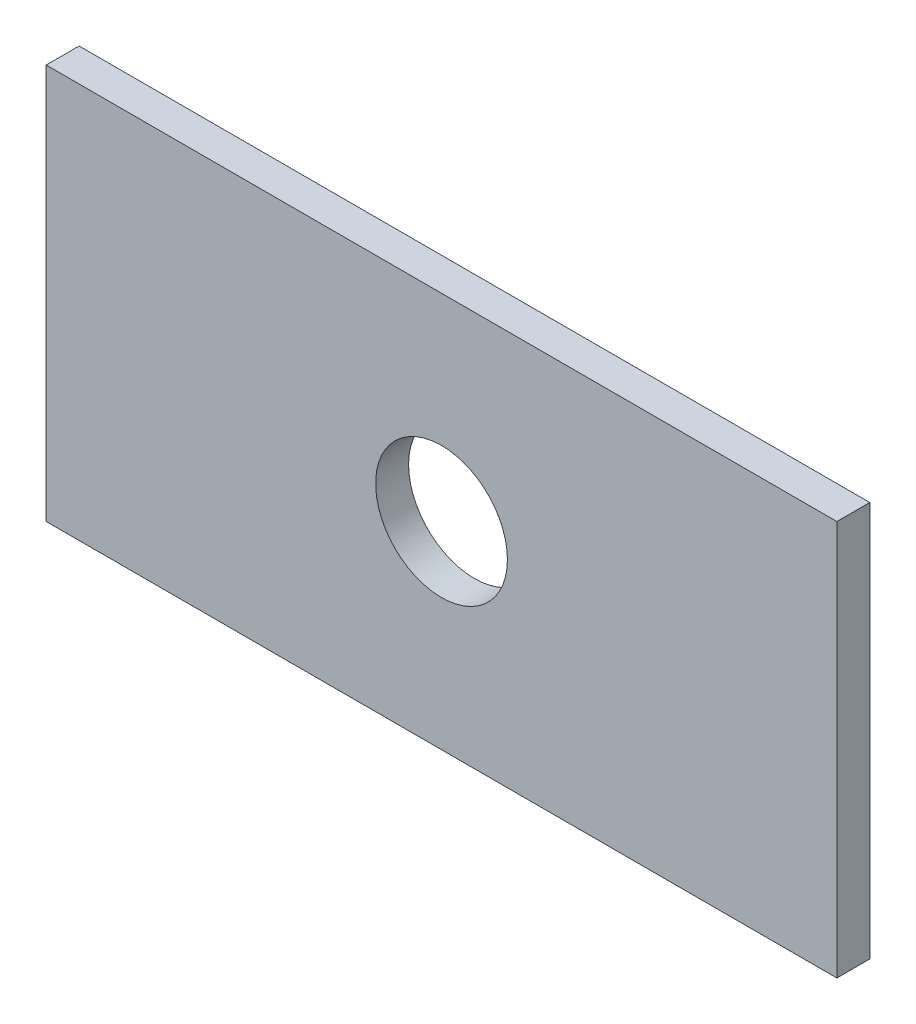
ISO-10303-21;
HEADER;
FILE_DESCRIPTION(('STEP AP214'),'2;1');
FILE_NAME('part.step','',(''),(''),'','','');
FILE_SCHEMA(('AUTOMOTIVE_DESIGN { 1 0 10303 214 1 1 1 1 }'));
ENDSEC;
DATA;
#1=APPLICATION_CONTEXT('core data for automotive mechanical design processes');
#2=APPLICATION_PROTOCOL_DEFINITION('international standard','automotive_design',2000,#1);
#3=PRODUCT_CONTEXT('',#1,'mechanical');
#4=PRODUCT('Part','Part','',(#3));
#5=PRODUCT_RELATED_PRODUCT_CATEGORY('part','',(#4));
#6=PRODUCT_DEFINITION_FORMATION('','',#4);
#7=PRODUCT_DEFINITION_CONTEXT('part definition',#1,'design');
#8=PRODUCT_DEFINITION('design','',#6,#7);
#9=PRODUCT_DEFINITION_SHAPE('','',#8);
#10=(LENGTH_UNIT() NAMED_UNIT(*) SI_UNIT(.MILLI.,.METRE.));
#11=(NAMED_UNIT(*) PLANE_ANGLE_UNIT() SI_UNIT($,.RADIAN.));
#12=(NAMED_UNIT(*) SI_UNIT($,.STERADIAN.) SOLID_ANGLE_UNIT());
#13=UNCERTAINTY_MEASURE_WITH_UNIT(LENGTH_MEASURE(1.E-05),#10,'distance_accuracy_value','');
#14=(GEOMETRIC_REPRESENTATION_CONTEXT(3) GLOBAL_UNCERTAINTY_ASSIGNED_CONTEXT((#13)) GLOBAL_UNIT_ASSIGNED_CONTEXT((#10,
#11,#12)) REPRESENTATION_CONTEXT('',''));
#15=CARTESIAN_POINT('',(0.,0.,0.));
#16=DIRECTION('',(0.,0.,1.));
#17=DIRECTION('',(1.,0.,0.));
#18=AXIS2_PLACEMENT_3D('',#15,#16,#17);
#19=CARTESIAN_POINT('',(0.,0.,5.));
#20=DIRECTION('',(1.,0.,0.));
#21=DIRECTION('',(0.,0.,-1.));
#22=AXIS2_PLACEMENT_3D('',#19,#20,#21);
#23=PLANE('',#22);
#24=DIRECTION('',(0.,-1.,0.));
#25=VECTOR('',#24,1.);
#26=CARTESIAN_POINT('',(0.,0.,0.));
#27=LINE('',#26,#25);
#28=CARTESIAN_POINT('',(0.,60.,0.));
#29=VERTEX_POINT('',#28);
#30=CARTESIAN_POINT('',(0.,0.,0.));
#31=VERTEX_POINT('',#30);
#32=EDGE_CURVE('E74',#29,#31,#27,.T.);
#33=ORIENTED_EDGE('',*,*,#32,.T.);
#34=DIRECTION('',(0.,0.,-1.));
#35=VECTOR('',#34,1.);
#36=CARTESIAN_POINT('',(0.,0.,5.));
#37=LINE('',#36,#35);
#38=CARTESIAN_POINT('',(0.,0.,5.));
#39=VERTEX_POINT('',#38);
#40=EDGE_CURVE('E11',#39,#31,#37,.T.);
#41=ORIENTED_EDGE('',*,*,#40,.F.);
#42=DIRECTION('',(0.,-1.,0.));
#43=VECTOR('',#42,1.);
#44=CARTESIAN_POINT('',(0.,0.,5.));
#45=LINE('',#44,#43);
#46=CARTESIAN_POINT('',(0.,60.,5.));
#47=VERTEX_POINT('',#46);
#48=EDGE_CURVE('E95',#47,#39,#45,.T.);
#49=ORIENTED_EDGE('',*,*,#48,.F.);
#50=DIRECTION('',(0.,0.,-1.));
#51=VECTOR('',#50,1.);
#52=CARTESIAN_POINT('',(0.,60.,5.));
#53=LINE('',#52,#51);
#54=EDGE_CURVE('E86',#47,#29,#53,.T.);
#55=ORIENTED_EDGE('',*,*,#54,.T.);
#56=EDGE_LOOP('',(#33,#41,#49,#55));
#57=FACE_BOUND('',#56,.T.);
#58=ADVANCED_FACE('F29',(#57),#23,.F.);
#59=CARTESIAN_POINT('',(0.,0.,5.));
#60=DIRECTION('',(0.,1.,0.));
#61=DIRECTION('',(0.,0.,1.));
#62=AXIS2_PLACEMENT_3D('',#59,#60,#61);
#63=PLANE('',#62);
#64=DIRECTION('',(1.,0.,0.));
#65=VECTOR('',#64,1.);
#66=CARTESIAN_POINT('',(0.,0.,0.));
#67=LINE('',#66,#65);
#68=CARTESIAN_POINT('',(120.,0.,0.));
#69=VERTEX_POINT('',#68);
#70=EDGE_CURVE('E70',#31,#69,#67,.T.);
#71=ORIENTED_EDGE('',*,*,#70,.T.);
#72=DIRECTION('',(0.,0.,-1.));
#73=VECTOR('',#72,1.);
#74=CARTESIAN_POINT('',(120.,0.,5.));
#75=LINE('',#74,#73);
#76=CARTESIAN_POINT('',(120.,0.,5.));
#77=VERTEX_POINT('',#76);
#78=EDGE_CURVE('E37',#77,#69,#75,.T.);
#79=ORIENTED_EDGE('',*,*,#78,.F.);
#80=DIRECTION('',(1.,0.,0.));
#81=VECTOR('',#80,1.);
#82=CARTESIAN_POINT('',(0.,0.,5.));
#83=LINE('',#82,#81);
#84=EDGE_CURVE('E82',#39,#77,#83,.T.);
#85=ORIENTED_EDGE('',*,*,#84,.F.);
#86=ORIENTED_EDGE('',*,*,#40,.T.);
#87=EDGE_LOOP('',(#71,#79,#85,#86));
#88=FACE_BOUND('',#87,.T.);
#89=ADVANCED_FACE('F81',(#88),#63,.F.);
#90=CARTESIAN_POINT('',(120.,0.,5.));
#91=DIRECTION('',(-1.,0.,0.));
#92=DIRECTION('',(0.,0.,1.));
#93=AXIS2_PLACEMENT_3D('',#90,#91,#92);
#94=PLANE('',#93);
#95=DIRECTION('',(0.,1.,0.));
#96=VECTOR('',#95,1.);
#97=CARTESIAN_POINT('',(120.,0.,0.));
#98=LINE('',#97,#96);
#99=CARTESIAN_POINT('',(120.,60.,0.));
#100=VERTEX_POINT('',#99);
#101=EDGE_CURVE('E75',#69,#100,#98,.T.);
#102=ORIENTED_EDGE('',*,*,#101,.T.);
#103=DIRECTION('',(0.,0.,-1.));
#104=VECTOR('',#103,1.);
#105=CARTESIAN_POINT('',(120.,60.,5.));
#106=LINE('',#105,#104);
#107=CARTESIAN_POINT('',(120.,60.,5.));
#108=VERTEX_POINT('',#107);
#109=EDGE_CURVE('E101',#108,#100,#106,.T.);
#110=ORIENTED_EDGE('',*,*,#109,.F.);
#111=DIRECTION('',(0.,1.,0.));
#112=VECTOR('',#111,1.);
#113=CARTESIAN_POINT('',(120.,0.,5.));
#114=LINE('',#113,#112);
#115=EDGE_CURVE('E49',#77,#108,#114,.T.);
#116=ORIENTED_EDGE('',*,*,#115,.F.);
#117=ORIENTED_EDGE('',*,*,#78,.T.);
#118=EDGE_LOOP('',(#102,#110,#116,#117));
#119=FACE_BOUND('',#118,.T.);
#120=ADVANCED_FACE('F105',(#119),#94,.F.);
#121=CARTESIAN_POINT('',(0.,60.,5.));
#122=DIRECTION('',(0.,-1.,0.));
#123=DIRECTION('',(0.,0.,-1.));
#124=AXIS2_PLACEMENT_3D('',#121,#122,#123);
#125=PLANE('',#124);
#126=DIRECTION('',(-1.,0.,0.));
#127=VECTOR('',#126,1.);
#128=CARTESIAN_POINT('',(0.,60.,0.));
#129=LINE('',#128,#127);
#130=EDGE_CURVE('E93',#100,#29,#129,.T.);
#131=ORIENTED_EDGE('',*,*,#130,.T.);
#132=ORIENTED_EDGE('',*,*,#54,.F.);
#133=DIRECTION('',(-1.,0.,0.));
#134=VECTOR('',#133,1.);
#135=CARTESIAN_POINT('',(0.,60.,5.));
#136=LINE('',#135,#134);
#137=EDGE_CURVE('E44',#108,#47,#136,.T.);
#138=ORIENTED_EDGE('',*,*,#137,.F.);
#139=ORIENTED_EDGE('',*,*,#109,.T.);
#140=EDGE_LOOP('',(#131,#132,#138,#139));
#141=FACE_BOUND('',#140,.T.);
#142=ADVANCED_FACE('F107',(#141),#125,.F.);
#143=CARTESIAN_POINT('',(0.,60.,5.));
#144=DIRECTION('',(0.,0.,-1.));
#145=DIRECTION('',(-1.,0.,0.));
#146=AXIS2_PLACEMENT_3D('',#143,#144,#145);
#147=PLANE('',#146);
#148=CARTESIAN_POINT('',(60.,30.,5.));
#149=DIRECTION('',(0.,0.,1.));
#150=DIRECTION('',(1.,0.,0.));
#151=AXIS2_PLACEMENT_3D('',#148,#149,#150);
#152=CIRCLE('',#151,10.);
#153=CARTESIAN_POINT('',(70.,30.,5.));
#154=VERTEX_POINT('',#153);
#155=EDGE_CURVE('E89',#154,#154,#152,.T.);
#156=ORIENTED_EDGE('',*,*,#155,.F.);
#157=EDGE_LOOP('',(#156));
#158=FACE_BOUND('',#157,.T.);
#159=ORIENTED_EDGE('',*,*,#48,.T.);
#160=ORIENTED_EDGE('',*,*,#84,.T.);
#161=ORIENTED_EDGE('',*,*,#115,.T.);
#162=ORIENTED_EDGE('',*,*,#137,.T.);
#163=EDGE_LOOP('',(#159,#160,#161,#162));
#164=FACE_BOUND('',#163,.T.);
#165=ADVANCED_FACE('F108',(#158,#164),#147,.F.);
#166=CARTESIAN_POINT('',(0.,60.,0.));
#167=DIRECTION('',(0.,0.,-1.));
#168=DIRECTION('',(-1.,0.,0.));
#169=AXIS2_PLACEMENT_3D('',#166,#167,#168);
#170=PLANE('',#169);
#171=CARTESIAN_POINT('',(60.,30.,0.));
#172=DIRECTION('',(0.,0.,-1.));
#173=DIRECTION('',(-1.,0.,0.));
#174=AXIS2_PLACEMENT_3D('',#171,#172,#173);
#175=CIRCLE('',#174,10.);
#176=CARTESIAN_POINT('',(50.,30.,0.));
#177=VERTEX_POINT('',#176);
#178=EDGE_CURVE('E32',#177,#177,#175,.T.);
#179=ORIENTED_EDGE('',*,*,#178,.F.);
#180=EDGE_LOOP('',(#179));
#181=FACE_BOUND('',#180,.T.);
#182=ORIENTED_EDGE('',*,*,#32,.F.);
#183=ORIENTED_EDGE('',*,*,#130,.F.);
#184=ORIENTED_EDGE('',*,*,#101,.F.);
#185=ORIENTED_EDGE('',*,*,#70,.F.);
#186=EDGE_LOOP('',(#182,#183,#184,#185));
#187=FACE_BOUND('',#186,.T.);
#188=ADVANCED_FACE('F71',(#181,#187),#170,.T.);
#189=CARTESIAN_POINT('',(60.,30.,5.));
#190=DIRECTION('',(0.,0.,1.));
#191=DIRECTION('',(1.,0.,0.));
#192=AXIS2_PLACEMENT_3D('',#189,#190,#191);
#193=CYLINDRICAL_SURFACE('',#192,10.);
#194=ORIENTED_EDGE('',*,*,#178,.T.);
#195=EDGE_LOOP('',(#194));
#196=FACE_BOUND('',#195,.T.);
#197=ORIENTED_EDGE('',*,*,#155,.T.);
#198=EDGE_LOOP('',(#197));
#199=FACE_BOUND('',#198,.T.);
#200=ADVANCED_FACE('F116',(#196,#199),#193,.F.);
#201=CLOSED_SHELL('',(#58,#89,#120,#142,#165,#188,#200));
#202=MANIFOLD_SOLID_BREP('B2',#201);
#203=ADVANCED_BREP_SHAPE_REPRESENTATION('',(#18,#202),#14);
#204=SHAPE_DEFINITION_REPRESENTATION(#9,#203);
ENDSEC;
END-ISO-10303-21;
